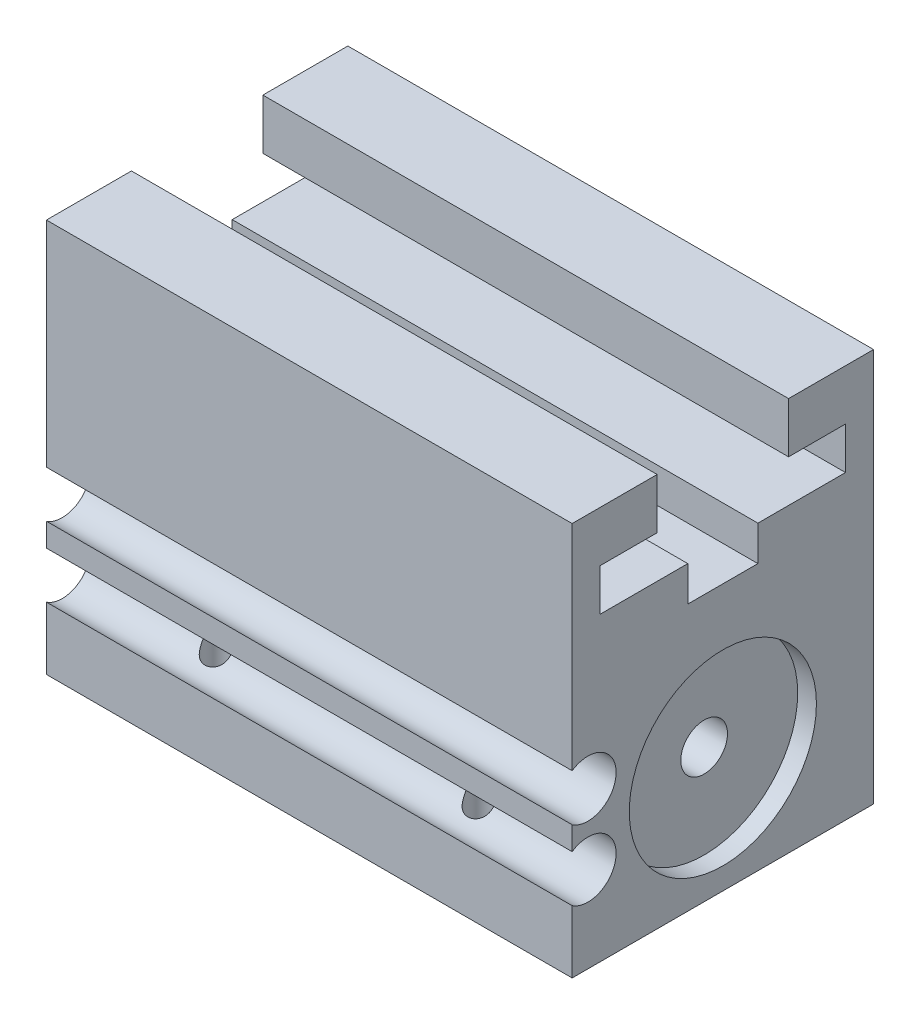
from build123d import *

# Parameters (mm, degrees)
EXTRUDE1_DEPTH     = 38.1
SKETCH2_R          = 6.7818
CUT_EXTRUDE1_DEPTH = 1.35636
SKETCH3_R          = 1.20269
CUT_EXTRUDE2_DEPTH = 3.048
SKETCH4_R          = 1.20269
CUT_EXTRUDE3_DEPTH = 3.048
CUT_EXTRUDE4_START = 1.35636
SKETCH9_R          = 6.7818
CUT_EXTRUDE4_DEPTH = 1.35636
SKETCH14_R         = 1.20269
CUT_EXTRUDE5_DEPTH = 3.175
SKETCH15_R         = 1.20269
CUT_EXTRUDE6_DEPTH = 3.175
SKETCH17_W         = 30.48
SKETCH17_H         = 1.69545


with BuildPart() as part:
    # Sketch1 → Extrude1 (new body)
    with BuildSketch(Plane(origin=(0, 0, 0), x_dir=(0, 0, -1), z_dir=(1, 0, 0))):
        with BuildLine():
            Line((-10.922, -14.2621), (10.922, -14.2621))
            Line((10.922, -14.2621), (10.922, 14.2621))
            Line((10.922, 14.2621), (4.7625, 14.2621))
            Line((4.7625, 14.2621), (4.7625, 10.6045))
            Line((4.7625, 10.6045), (8.89, 10.6045))
            Line((8.89, 10.6045), (8.89, 7.5565))
            Line((8.89, 7.5565), (2.54, 7.5565))
            Line((2.54, 7.5565), (2.54, 5.0165))
            Line((2.54, 5.0165), (-2.54, 5.0165))
            Line((-2.54, 5.0165), (-2.54, 7.5565))
            Line((-2.54, 7.5565), (-8.89, 7.5565))
            Line((-8.89, 7.5565), (-8.89, 10.6045))
            Line((-8.89, 10.6045), (-4.7625, 10.6045))
            Line((-4.7625, 10.6045), (-4.7625, 14.2621))
            Line((-4.7625, 14.2621), (-10.922, 14.2621))
            Line((-10.922, 14.2621), (-10.922, -1.252279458))
            ThreePointArc((-10.922, -1.252279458), (-7.7343, -2.94767), (-10.922, -4.643060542))
            Line((-10.922, -4.643060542), (-10.922, -6.332279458))
            ThreePointArc((-10.922, -6.332279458), (-7.7343, -8.02767), (-10.922, -9.723060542))
            Line((-10.922, -9.723060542), (-10.922, -14.2621))
        make_face()
    extrude(amount=EXTRUDE1_DEPTH)

    # Sketch2 → Cut-Extrude1 (cut)
    with BuildSketch(Plane(origin=(38.1, 0, 0), x_dir=(0, 0, -1), z_dir=(1, 0, 0))):
        with Locations((0, -5.9055)):
            Circle(SKETCH2_R)
    extrude(amount=-CUT_EXTRUDE1_DEPTH, mode=Mode.SUBTRACT)

    # Sketch3 → Cut-Extrude2 (cut)
    with BuildSketch(Plane(origin=(0, 0, 0), x_dir=(0, 0, -1), z_dir=(1, 0, 0))):
        with Locations(Location((8.7249, 4.4069, 0), (0, 0, 180))):
            Circle(SKETCH3_R)
    extrude(amount=CUT_EXTRUDE2_DEPTH, mode=Mode.SUBTRACT)

    # Sketch4 → Cut-Extrude3 (cut)
    with BuildSketch(Plane(origin=(0, 0, 0), x_dir=(0, 0, -1), z_dir=(1, 0, 0))):
        with Locations(Location((-8.7249, -11.4681, 0), (0, 0, 180))):
            Circle(SKETCH4_R)
    extrude(amount=CUT_EXTRUDE3_DEPTH, mode=Mode.SUBTRACT)

    # Sketch5 → Cut-Revolve1 (revolve, cut)
    with BuildSketch(Plane.XY.offset(8.7249), mode=Mode.PRIVATE) as cut_revolve1_sk:
        Polygon((0, 4.4069), (0, 5.8039), (0.381, 5.4229), (6.271412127, 5.4229), (6.858, 4.4069), align=None)
    revolve(cut_revolve1_sk.sketch.rotate(Axis((6.858, 4.4069, 8.7249), (-1, 0, 0)), 270), axis=Axis((6.858, 4.4069, 8.7249), (-1, 0, 0)), mode=Mode.SUBTRACT)

    # Sketch6 → Cut-Revolve2 (revolve, cut)
    with BuildSketch(Plane.XY.offset(-8.7249), mode=Mode.PRIVATE) as cut_revolve2_sk:
        Polygon((0, -11.4681), (0, -10.0711), (0.381, -10.4521), (6.271412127, -10.4521), (6.858, -11.4681), align=None)
    revolve(cut_revolve2_sk.sketch.rotate(Axis((6.858, -11.4681, -8.7249), (-1, 0, 0)), 270), axis=Axis((6.858, -11.4681, -8.7249), (-1, 0, 0)), mode=Mode.SUBTRACT)

    # Sketch7 → Cut-Revolve3 (revolve, cut)
    with BuildSketch(Plane(origin=(7.62, 0, 0), x_dir=(0, 0, -1), z_dir=(1, 0, 0)), mode=Mode.PRIVATE) as cut_revolve3_sk:
        Polygon((6.35, 1.5621), (6.35, 3.5052), (10.4521, 3.5052), (10.922, 3.9751), (10.922, 1.5621), align=None)
    revolve(cut_revolve3_sk.sketch.rotate(Axis((7.62, 1.5621, -10.922), (0, 0, 1)), 270), axis=Axis((7.62, 1.5621, -10.922), (0, 0, 1)), mode=Mode.SUBTRACT)

    # Sketch8 → Cut-Revolve4 (revolve, cut)
    with BuildSketch(Plane(origin=(30.734, 0, 0), x_dir=(0, 0, -1), z_dir=(1, 0, 0)), mode=Mode.PRIVATE) as cut_revolve4_sk:
        Polygon((6.35, 1.5621), (6.35, 3.5052), (10.4521, 3.5052), (10.922, 3.9751), (10.922, 1.5621), align=None)
    revolve(cut_revolve4_sk.sketch.rotate(Axis((30.734, 1.5621, -10.922), (0, 0, 1)), 270), axis=Axis((30.734, 1.5621, -10.922), (0, 0, 1)), mode=Mode.SUBTRACT)

    # Sketch9 → Cut-Extrude4 (cut)
    with BuildSketch(Plane(origin=(0, 0, 0), x_dir=(0, 0, -1), z_dir=(1, 0, 0)).offset(CUT_EXTRUDE4_START)):
        with Locations((0, -5.9055)):
            Circle(SKETCH9_R)
    extrude(amount=-CUT_EXTRUDE4_DEPTH, mode=Mode.SUBTRACT)

    # Sketch10 → Cut-Revolve5 (revolve, cut)
    with BuildSketch(Plane(origin=(9.525, 0, 0), x_dir=(0, 0, -1), z_dir=(1, 0, 0)), mode=Mode.PRIVATE) as cut_revolve5_sk:
        Polygon((-7.9375, -14.2621), (-9.3345, -14.2621), (-8.9535, -13.8811), (-8.9535, -8.905087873), (-7.9375, -8.3185), align=None)
    revolve(cut_revolve5_sk.sketch.rotate(Axis((9.525, -8.3185, 7.9375), (0, -1, 0)), 180), axis=Axis((9.525, -8.3185, 7.9375), (0, -1, 0)), mode=Mode.SUBTRACT)

    # Sketch11 → Cut-Revolve6 (revolve, cut)
    with BuildSketch(Plane(origin=(28.575, 0, 0), x_dir=(0, 0, -1), z_dir=(1, 0, 0)), mode=Mode.PRIVATE) as cut_revolve6_sk:
        Polygon((-7.9375, -14.2621), (-9.3345, -14.2621), (-8.9535, -13.8811), (-8.9535, -8.905087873), (-7.9375, -8.3185), align=None)
    revolve(cut_revolve6_sk.sketch.rotate(Axis((28.575, -8.3185, 7.9375), (0, -1, 0)), 180), axis=Axis((28.575, -8.3185, 7.9375), (0, -1, 0)), mode=Mode.SUBTRACT)

    # Sketch12 → Cut-Revolve7 (revolve, cut)
    with BuildSketch(Plane(origin=(28.575, 0, 0), x_dir=(0, 0, -1), z_dir=(1, 0, 0)), mode=Mode.PRIVATE) as cut_revolve7_sk:
        Polygon((7.9375, -14.2621), (6.5405, -14.2621), (6.9215, -13.8811), (6.9215, -8.905087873), (7.9375, -8.3185), align=None)
    revolve(cut_revolve7_sk.sketch.rotate(Axis((28.575, -8.3185, -7.9375), (0, -1, 0)), 180), axis=Axis((28.575, -8.3185, -7.9375), (0, -1, 0)), mode=Mode.SUBTRACT)

    # Sketch13 → Cut-Revolve8 (revolve, cut)
    with BuildSketch(Plane(origin=(9.525, 0, 0), x_dir=(0, 0, -1), z_dir=(1, 0, 0)), mode=Mode.PRIVATE) as cut_revolve8_sk:
        Polygon((7.9375, -14.2621), (6.5405, -14.2621), (6.9215, -13.8811), (6.9215, -8.905087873), (7.9375, -8.3185), align=None)
    revolve(cut_revolve8_sk.sketch.rotate(Axis((9.525, -8.3185, -7.9375), (0, -1, 0)), 180), axis=Axis((9.525, -8.3185, -7.9375), (0, -1, 0)), mode=Mode.SUBTRACT)

    # Sketch14 → Cut-Extrude5 (cut)
    with BuildSketch(Plane(origin=(0, -14.2621, 0), x_dir=(-1, 0, 0), z_dir=(0, 1, 0))):
        with Locations(Location((-15.875, 7.9375, 0), (0, 0, 90))):
            Circle(SKETCH14_R)
    extrude(amount=CUT_EXTRUDE5_DEPTH, mode=Mode.SUBTRACT)

    # Sketch15 → Cut-Extrude6 (cut)
    with BuildSketch(Plane(origin=(0, -14.2621, 0), x_dir=(-1, 0, 0), z_dir=(0, 1, 0))):
        with Locations(Location((-22.225, -7.9375, 0), (0, 0, 90))):
            Circle(SKETCH15_R)
    extrude(amount=CUT_EXTRUDE6_DEPTH, mode=Mode.SUBTRACT)

    # Sketch16 → Cut-Revolve9 (revolve, cut)
    with BuildSketch(Plane.XY, mode=Mode.PRIVATE) as cut_revolve9_sk:
        Polygon((0, 2.8194), (0, 4.8514), (0.381, 4.4704), (3.048, 4.4704), (3.048, 2.8194), align=None)
    revolve(cut_revolve9_sk.sketch.rotate(Axis((3.048, 2.8194, 0), (-1, 0, 0)), 270), axis=Axis((3.048, 2.8194, 0), (-1, 0, 0)), mode=Mode.SUBTRACT)

    # Sketch17 → Cut-Revolve10 (revolve, cut)
    with BuildSketch(Plane.XY, mode=Mode.PRIVATE) as cut_revolve10_sk:
        with Locations((21.50364, -5.057775)):
            Rectangle(SKETCH17_W, SKETCH17_H)
    revolve(cut_revolve10_sk.sketch.rotate(Axis((36.74364, -5.9055, 0), (-1, 0, 0)), 355.571026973), axis=Axis((36.74364, -5.9055, 0), (-1, 0, 0)), mode=Mode.SUBTRACT)


solid = part.part
